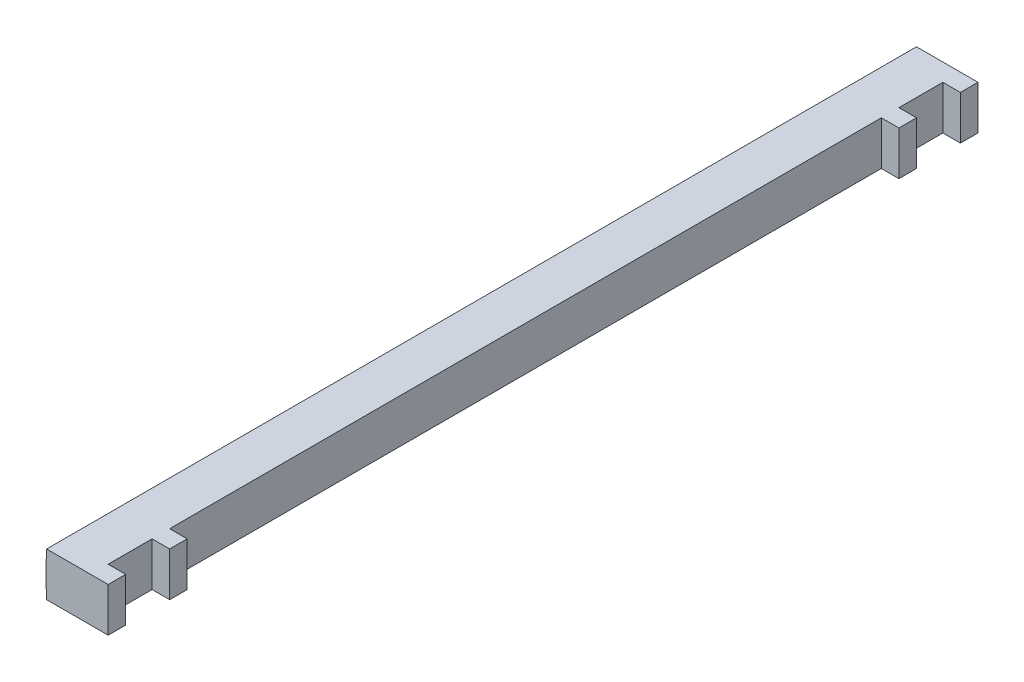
from build123d import *

# Parameters (mm, degrees)
BOSS_EXTRUDE1_DEPTH = 173.99
SKETCH2_W           = 2.54
SKETCH2_H           = 6.35
BOSS_EXTRUDE2_DEPTH = 2.54
SKETCH3_W           = 21.983612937
SKETCH3_H           = 50.983272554
CUT_EXTRUDE1_DEPTH  = 42.672


with BuildPart() as part:
    # Sketch1 → Boss-Extrude1 (new body)
    with BuildSketch(Plane.XY):
        with BuildLine():
            Line((-47.519048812, 3.175), (-41.169048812, 3.175))
            Line((-41.169048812, 3.175), (-41.169048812, -3.175))
            Line((-41.169048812, -3.175), (-47.519048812, -3.175))
            ThreePointArc((-47.519048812, -3.175), (-47.625, 0), (-47.519048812, 3.175))
        make_face()
    extrude(amount=BOSS_EXTRUDE1_DEPTH)

    # Sketch2 → Boss-Extrude2 (add)
    with BuildSketch(Plane(origin=(-41.169048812, 0, 0), x_dir=(0, 0, -1), z_dir=(1, 0, 0))):
        with Locations((-124.46, 0)):
            Rectangle(SKETCH2_W, SKETCH2_H)
        with Locations((-115.57, 0)):
            Rectangle(SKETCH2_W, SKETCH2_H)
        with Locations((-10.16, 0)):
            Rectangle(SKETCH2_W, SKETCH2_H)
        with Locations((-1.27, 0)):
            Rectangle(SKETCH2_W, SKETCH2_H)
    extrude(amount=BOSS_EXTRUDE2_DEPTH)

    # Sketch3 → Cut-Extrude1 (cut)
    with BuildSketch(Plane(origin=(0, -3.175, 0), x_dir=(-1, 0, 0), z_dir=(0, -1, 0))):
        with Locations((48.155191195, -151.221636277)):
            Rectangle(SKETCH3_W, SKETCH3_H)
    extrude(amount=-CUT_EXTRUDE1_DEPTH, mode=Mode.SUBTRACT)


solid = part.part
